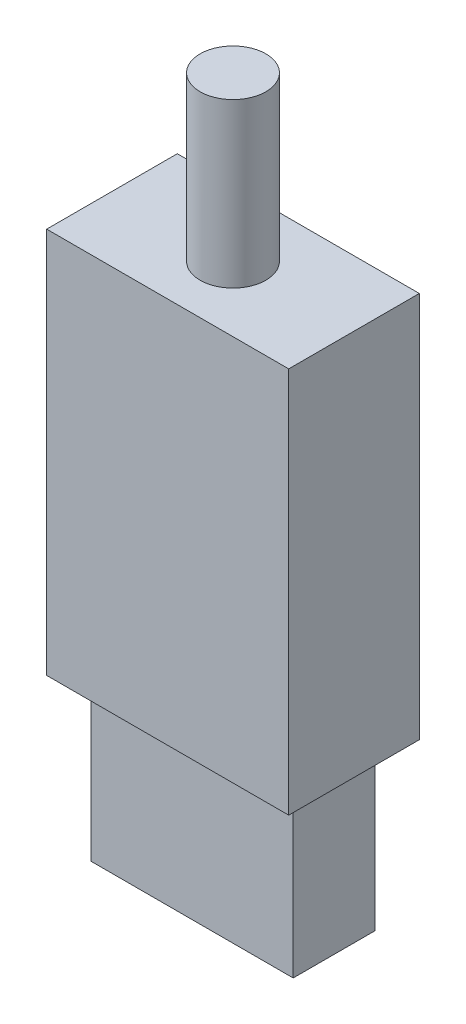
from build123d import *

# Parameters (mm, degrees)
SKETCH1_W           = 12.573
SKETCH1_H           = 5.08
BOSS_EXTRUDE1_DEPTH = 10.16
SKETCH2_W           = 15.0622
SKETCH2_H           = 8.128
BOSS_EXTRUDE2_DEPTH = 24.0538
SKETCH3_R           = 2.0447
BOSS_EXTRUDE3_DEPTH = 10.16


with BuildPart() as part:
    # Sketch1 → Boss-Extrude1 (new body)
    with BuildSketch(Plane(origin=(0, 0, 0), x_dir=(1, 0, 0), z_dir=(0, 1, 0))):
        with Locations((6.2865, 2.54)):
            Rectangle(SKETCH1_W, SKETCH1_H)
    extrude(amount=BOSS_EXTRUDE1_DEPTH)

    # Sketch2 → Boss-Extrude2 (add)
    with BuildSketch(Plane(origin=(0, 10.16, 0), x_dir=(1, 0, 0), z_dir=(0, 1, 0))):
        with Locations((6.2865, 2.54)):
            Rectangle(SKETCH2_W, SKETCH2_H)
    extrude(amount=BOSS_EXTRUDE2_DEPTH)

    # Sketch3 → Boss-Extrude3 (add)
    with BuildSketch(Plane(origin=(0, 34.2138, 0), x_dir=(1, 0, 0), z_dir=(0, 1, 0))):
        with Locations(Location((6.2865, 2.54, 0), (0, 0, 90))):
            Circle(SKETCH3_R)
    extrude(amount=BOSS_EXTRUDE3_DEPTH)


solid = part.part
